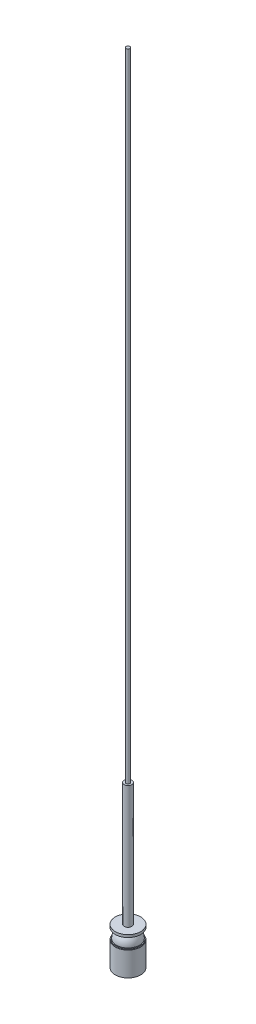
ISO-10303-21;
HEADER;
FILE_DESCRIPTION(('STEP AP214'),'2;1');
FILE_NAME('part.step','',(''),(''),'','','');
FILE_SCHEMA(('AUTOMOTIVE_DESIGN { 1 0 10303 214 1 1 1 1 }'));
ENDSEC;
DATA;
#1=APPLICATION_CONTEXT('core data for automotive mechanical design processes');
#2=APPLICATION_PROTOCOL_DEFINITION('international standard','automotive_design',2000,#1);
#3=PRODUCT_CONTEXT('',#1,'mechanical');
#4=PRODUCT('Part','Part','',(#3));
#5=PRODUCT_RELATED_PRODUCT_CATEGORY('part','',(#4));
#6=PRODUCT_DEFINITION_FORMATION('','',#4);
#7=PRODUCT_DEFINITION_CONTEXT('part definition',#1,'design');
#8=PRODUCT_DEFINITION('design','',#6,#7);
#9=PRODUCT_DEFINITION_SHAPE('','',#8);
#10=(LENGTH_UNIT() NAMED_UNIT(*) SI_UNIT(.MILLI.,.METRE.));
#11=(NAMED_UNIT(*) PLANE_ANGLE_UNIT() SI_UNIT($,.RADIAN.));
#12=(NAMED_UNIT(*) SI_UNIT($,.STERADIAN.) SOLID_ANGLE_UNIT());
#13=UNCERTAINTY_MEASURE_WITH_UNIT(LENGTH_MEASURE(1.E-05),#10,'distance_accuracy_value','');
#14=(GEOMETRIC_REPRESENTATION_CONTEXT(3) GLOBAL_UNCERTAINTY_ASSIGNED_CONTEXT((#13)) GLOBAL_UNIT_ASSIGNED_CONTEXT((#10,
#11,#12)) REPRESENTATION_CONTEXT('',''));
#15=CARTESIAN_POINT('',(0.,0.,0.));
#16=DIRECTION('',(0.,0.,1.));
#17=DIRECTION('',(1.,0.,0.));
#18=AXIS2_PLACEMENT_3D('',#15,#16,#17);
#19=CARTESIAN_POINT('',(0.,193.,0.));
#20=DIRECTION('',(0.,1.,0.));
#21=DIRECTION('',(0.,0.,1.));
#22=AXIS2_PLACEMENT_3D('',#19,#20,#21);
#23=PLANE('',#22);
#24=CARTESIAN_POINT('',(0.,193.,0.));
#25=DIRECTION('',(0.,-1.,0.));
#26=DIRECTION('',(0.,0.,-1.));
#27=AXIS2_PLACEMENT_3D('',#24,#25,#26);
#28=CIRCLE('',#27,3.);
#29=CARTESIAN_POINT('',(0.,193.,-3.));
#30=VERTEX_POINT('',#29);
#31=EDGE_CURVE('E90',#30,#30,#28,.T.);
#32=ORIENTED_EDGE('',*,*,#31,.T.);
#33=EDGE_LOOP('',(#32));
#34=FACE_BOUND('',#33,.T.);
#35=CARTESIAN_POINT('',(0.,193.,0.));
#36=DIRECTION('',(0.,-1.,0.));
#37=DIRECTION('',(0.,0.,-1.));
#38=AXIS2_PLACEMENT_3D('',#35,#36,#37);
#39=CIRCLE('',#38,6.);
#40=CARTESIAN_POINT('',(0.,193.,-6.));
#41=VERTEX_POINT('',#40);
#42=EDGE_CURVE('E10',#41,#41,#39,.T.);
#43=ORIENTED_EDGE('',*,*,#42,.F.);
#44=EDGE_LOOP('',(#43));
#45=FACE_BOUND('',#44,.T.);
#46=ADVANCED_FACE('F39',(#34,#45),#23,.T.);
#47=CARTESIAN_POINT('',(0.,0.,0.));
#48=DIRECTION('',(0.,-1.,0.));
#49=DIRECTION('',(0.,0.,-1.));
#50=AXIS2_PLACEMENT_3D('',#47,#48,#49);
#51=CYLINDRICAL_SURFACE('',#50,6.00000000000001);
#52=ORIENTED_EDGE('',*,*,#42,.T.);
#53=EDGE_LOOP('',(#52));
#54=FACE_BOUND('',#53,.T.);
#55=CARTESIAN_POINT('',(0.,0.,0.));
#56=DIRECTION('',(0.,-1.,0.));
#57=DIRECTION('',(0.,0.,-1.));
#58=AXIS2_PLACEMENT_3D('',#55,#56,#57);
#59=CIRCLE('',#58,6.00000000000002);
#60=CARTESIAN_POINT('',(0.,0.,-6.00000000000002));
#61=VERTEX_POINT('',#60);
#62=EDGE_CURVE('E46',#61,#61,#59,.T.);
#63=ORIENTED_EDGE('',*,*,#62,.F.);
#64=EDGE_LOOP('',(#63));
#65=FACE_BOUND('',#64,.T.);
#66=ADVANCED_FACE('F109',(#54,#65),#51,.T.);
#67=CARTESIAN_POINT('',(0.,0.,0.));
#68=DIRECTION('',(0.,1.,0.));
#69=DIRECTION('',(0.,0.,1.));
#70=AXIS2_PLACEMENT_3D('',#67,#68,#69);
#71=PLANE('',#70);
#72=ORIENTED_EDGE('',*,*,#62,.T.);
#73=EDGE_LOOP('',(#72));
#74=FACE_BOUND('',#73,.T.);
#75=CARTESIAN_POINT('',(0.,0.,0.));
#76=DIRECTION('',(0.,-1.,0.));
#77=DIRECTION('',(0.,0.,-1.));
#78=AXIS2_PLACEMENT_3D('',#75,#76,#77);
#79=CIRCLE('',#78,20.);
#80=CARTESIAN_POINT('',(0.,0.,-20.));
#81=VERTEX_POINT('',#80);
#82=EDGE_CURVE('E51',#81,#81,#79,.T.);
#83=ORIENTED_EDGE('',*,*,#82,.F.);
#84=EDGE_LOOP('',(#83));
#85=FACE_BOUND('',#84,.T.);
#86=ADVANCED_FACE('F113',(#74,#85),#71,.T.);
#87=CARTESIAN_POINT('',(0.,-4.,0.));
#88=DIRECTION('',(0.,-1.,0.));
#89=DIRECTION('',(0.,0.,-1.));
#90=AXIS2_PLACEMENT_3D('',#87,#88,#89);
#91=CYLINDRICAL_SURFACE('',#90,20.);
#92=ORIENTED_EDGE('',*,*,#82,.T.);
#93=EDGE_LOOP('',(#92));
#94=FACE_BOUND('',#93,.T.);
#95=CARTESIAN_POINT('',(0.,-4.,0.));
#96=DIRECTION('',(0.,-1.,0.));
#97=DIRECTION('',(0.,0.,-1.));
#98=AXIS2_PLACEMENT_3D('',#95,#96,#97);
#99=CIRCLE('',#98,20.);
#100=CARTESIAN_POINT('',(0.,-4.,-20.));
#101=VERTEX_POINT('',#100);
#102=EDGE_CURVE('E56',#101,#101,#99,.T.);
#103=ORIENTED_EDGE('',*,*,#102,.F.);
#104=EDGE_LOOP('',(#103));
#105=FACE_BOUND('',#104,.T.);
#106=ADVANCED_FACE('F117',(#94,#105),#91,.T.);
#107=CARTESIAN_POINT('',(20.,-4.,0.));
#108=DIRECTION('',(0.,-1.,0.));
#109=DIRECTION('',(0.,0.,-1.));
#110=AXIS2_PLACEMENT_3D('',#107,#108,#109);
#111=PLANE('',#110);
#112=CARTESIAN_POINT('',(0.,-4.,0.));
#113=DIRECTION('',(0.,1.,0.));
#114=DIRECTION('',(-1.,0.,0.));
#115=AXIS2_PLACEMENT_3D('',#112,#113,#114);
#116=CIRCLE('',#115,10.0908898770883);
#117=CARTESIAN_POINT('',(-10.0908898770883,-4.,0.));
#118=VERTEX_POINT('',#117);
#119=EDGE_CURVE('E62',#118,#118,#116,.T.);
#120=ORIENTED_EDGE('',*,*,#119,.T.);
#121=EDGE_LOOP('',(#120));
#122=FACE_BOUND('',#121,.T.);
#123=ORIENTED_EDGE('',*,*,#102,.T.);
#124=EDGE_LOOP('',(#123));
#125=FACE_BOUND('',#124,.T.);
#126=ADVANCED_FACE('F123',(#122,#125),#111,.T.);
#127=CARTESIAN_POINT('',(0.,-18.5788087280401,0.));
#128=DIRECTION('',(0.,1.,0.));
#129=DIRECTION('',(-1.,0.,0.));
#130=AXIS2_PLACEMENT_3D('',#127,#128,#129);
#131=DEGENERATE_TOROIDAL_SURFACE('',#130,0.930705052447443,17.217742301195,.T.);
#132=ORIENTED_EDGE('',*,*,#119,.F.);
#133=EDGE_LOOP('',(#132));
#134=FACE_BOUND('',#133,.T.);
#135=CARTESIAN_POINT('',(0.,-19.4700412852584,0.));
#136=DIRECTION('',(0.,1.,0.));
#137=DIRECTION('',(-1.,0.,0.));
#138=AXIS2_PLACEMENT_3D('',#135,#136,#137);
#139=CIRCLE('',#138,18.1253656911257);
#140=CARTESIAN_POINT('',(-18.1253656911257,-19.4700412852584,0.));
#141=VERTEX_POINT('',#140);
#142=EDGE_CURVE('E66',#141,#141,#139,.T.);
#143=ORIENTED_EDGE('',*,*,#142,.T.);
#144=EDGE_LOOP('',(#143));
#145=FACE_BOUND('',#144,.T.);
#146=ADVANCED_FACE('F127',(#134,#145),#131,.T.);
#147=CARTESIAN_POINT('',(19.3132785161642,-19.4700412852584,0.));
#148=DIRECTION('',(0.,-1.,0.));
#149=DIRECTION('',(1.,0.,0.));
#150=AXIS2_PLACEMENT_3D('',#147,#148,#149);
#151=PLANE('',#150);
#152=ORIENTED_EDGE('',*,*,#142,.F.);
#153=EDGE_LOOP('',(#152));
#154=FACE_BOUND('',#153,.T.);
#155=CARTESIAN_POINT('',(0.,-19.4700412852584,0.));
#156=DIRECTION('',(0.,1.,0.));
#157=DIRECTION('',(-1.,0.,0.));
#158=AXIS2_PLACEMENT_3D('',#155,#156,#157);
#159=CIRCLE('',#158,19.3132785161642);
#160=CARTESIAN_POINT('',(-19.3132785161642,-19.4700412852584,0.));
#161=VERTEX_POINT('',#160);
#162=EDGE_CURVE('E70',#161,#161,#159,.T.);
#163=ORIENTED_EDGE('',*,*,#162,.T.);
#164=EDGE_LOOP('',(#163));
#165=FACE_BOUND('',#164,.T.);
#166=ADVANCED_FACE('F131',(#154,#165),#151,.F.);
#167=CARTESIAN_POINT('',(0.,-4.,0.));
#168=DIRECTION('',(0.,1.,0.));
#169=DIRECTION('',(-1.,0.,0.));
#170=AXIS2_PLACEMENT_3D('',#167,#168,#169);
#171=CYLINDRICAL_SURFACE('',#170,19.3132785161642);
#172=ORIENTED_EDGE('',*,*,#162,.F.);
#173=EDGE_LOOP('',(#172));
#174=FACE_BOUND('',#173,.T.);
#175=CARTESIAN_POINT('',(0.,-21.,0.));
#176=DIRECTION('',(0.,1.,0.));
#177=DIRECTION('',(-1.,0.,0.));
#178=AXIS2_PLACEMENT_3D('',#175,#176,#177);
#179=CIRCLE('',#178,19.3132785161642);
#180=CARTESIAN_POINT('',(-19.3132785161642,-21.,0.));
#181=VERTEX_POINT('',#180);
#182=EDGE_CURVE('E74',#181,#181,#179,.T.);
#183=ORIENTED_EDGE('',*,*,#182,.T.);
#184=EDGE_LOOP('',(#183));
#185=FACE_BOUND('',#184,.T.);
#186=ADVANCED_FACE('F135',(#174,#185),#171,.T.);
#187=CARTESIAN_POINT('',(20.,-21.,0.));
#188=DIRECTION('',(0.,-1.,0.));
#189=DIRECTION('',(1.,0.,0.));
#190=AXIS2_PLACEMENT_3D('',#187,#188,#189);
#191=PLANE('',#190);
#192=ORIENTED_EDGE('',*,*,#182,.F.);
#193=EDGE_LOOP('',(#192));
#194=FACE_BOUND('',#193,.T.);
#195=CARTESIAN_POINT('',(0.,-21.,0.));
#196=DIRECTION('',(0.,1.,0.));
#197=DIRECTION('',(-1.,0.,0.));
#198=AXIS2_PLACEMENT_3D('',#195,#196,#197);
#199=CIRCLE('',#198,20.);
#200=CARTESIAN_POINT('',(-20.,-21.,0.));
#201=VERTEX_POINT('',#200);
#202=EDGE_CURVE('E78',#201,#201,#199,.T.);
#203=ORIENTED_EDGE('',*,*,#202,.T.);
#204=EDGE_LOOP('',(#203));
#205=FACE_BOUND('',#204,.T.);
#206=ADVANCED_FACE('F139',(#194,#205),#191,.F.);
#207=CARTESIAN_POINT('',(0.,-4.,0.));
#208=DIRECTION('',(0.,1.,0.));
#209=DIRECTION('',(-1.,0.,0.));
#210=AXIS2_PLACEMENT_3D('',#207,#208,#209);
#211=CYLINDRICAL_SURFACE('',#210,20.);
#212=ORIENTED_EDGE('',*,*,#202,.F.);
#213=EDGE_LOOP('',(#212));
#214=FACE_BOUND('',#213,.T.);
#215=CARTESIAN_POINT('',(0.,-59.,0.));
#216=DIRECTION('',(0.,1.,0.));
#217=DIRECTION('',(-1.,0.,0.));
#218=AXIS2_PLACEMENT_3D('',#215,#216,#217);
#219=CIRCLE('',#218,20.);
#220=CARTESIAN_POINT('',(-20.,-59.,0.));
#221=VERTEX_POINT('',#220);
#222=EDGE_CURVE('E82',#221,#221,#219,.T.);
#223=ORIENTED_EDGE('',*,*,#222,.T.);
#224=EDGE_LOOP('',(#223));
#225=FACE_BOUND('',#224,.T.);
#226=ADVANCED_FACE('F143',(#214,#225),#211,.T.);
#227=CARTESIAN_POINT('',(0.,-59.,0.));
#228=DIRECTION('',(0.,1.,0.));
#229=DIRECTION('',(-1.,0.,0.));
#230=AXIS2_PLACEMENT_3D('',#227,#228,#229);
#231=PLANE('',#230);
#232=ORIENTED_EDGE('',*,*,#222,.F.);
#233=EDGE_LOOP('',(#232));
#234=FACE_BOUND('',#233,.T.);
#235=ADVANCED_FACE('F105',(#234),#231,.F.);
#236=CARTESIAN_POINT('',(0.,1193.,0.));
#237=DIRECTION('',(0.,1.,0.));
#238=DIRECTION('',(0.,0.,1.));
#239=AXIS2_PLACEMENT_3D('',#236,#237,#238);
#240=PLANE('',#239);
#241=CARTESIAN_POINT('',(0.,1193.,0.));
#242=DIRECTION('',(0.,-1.,0.));
#243=DIRECTION('',(0.,0.,-1.));
#244=AXIS2_PLACEMENT_3D('',#241,#242,#243);
#245=CIRCLE('',#244,2.9999999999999);
#246=CARTESIAN_POINT('',(0.,1193.,-2.9999999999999));
#247=VERTEX_POINT('',#246);
#248=EDGE_CURVE('E86',#247,#247,#245,.T.);
#249=ORIENTED_EDGE('',*,*,#248,.F.);
#250=EDGE_LOOP('',(#249));
#251=FACE_BOUND('',#250,.T.);
#252=ADVANCED_FACE('F99',(#251),#240,.T.);
#253=CARTESIAN_POINT('',(0.,193.,0.));
#254=DIRECTION('',(0.,-1.,0.));
#255=DIRECTION('',(0.,0.,-1.));
#256=AXIS2_PLACEMENT_3D('',#253,#254,#255);
#257=CYLINDRICAL_SURFACE('',#256,2.99999999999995);
#258=ORIENTED_EDGE('',*,*,#248,.T.);
#259=EDGE_LOOP('',(#258));
#260=FACE_BOUND('',#259,.T.);
#261=ORIENTED_EDGE('',*,*,#31,.F.);
#262=EDGE_LOOP('',(#261));
#263=FACE_BOUND('',#262,.T.);
#264=ADVANCED_FACE('F97',(#260,#263),#257,.T.);
#265=CLOSED_SHELL('',(#46,#66,#86,#106,#126,#146,#166,#186,#206,#226,#235,#252,#264));
#266=MANIFOLD_SOLID_BREP('B2',#265);
#267=ADVANCED_BREP_SHAPE_REPRESENTATION('',(#18,#266),#14);
#268=SHAPE_DEFINITION_REPRESENTATION(#9,#267);
ENDSEC;
END-ISO-10303-21;
